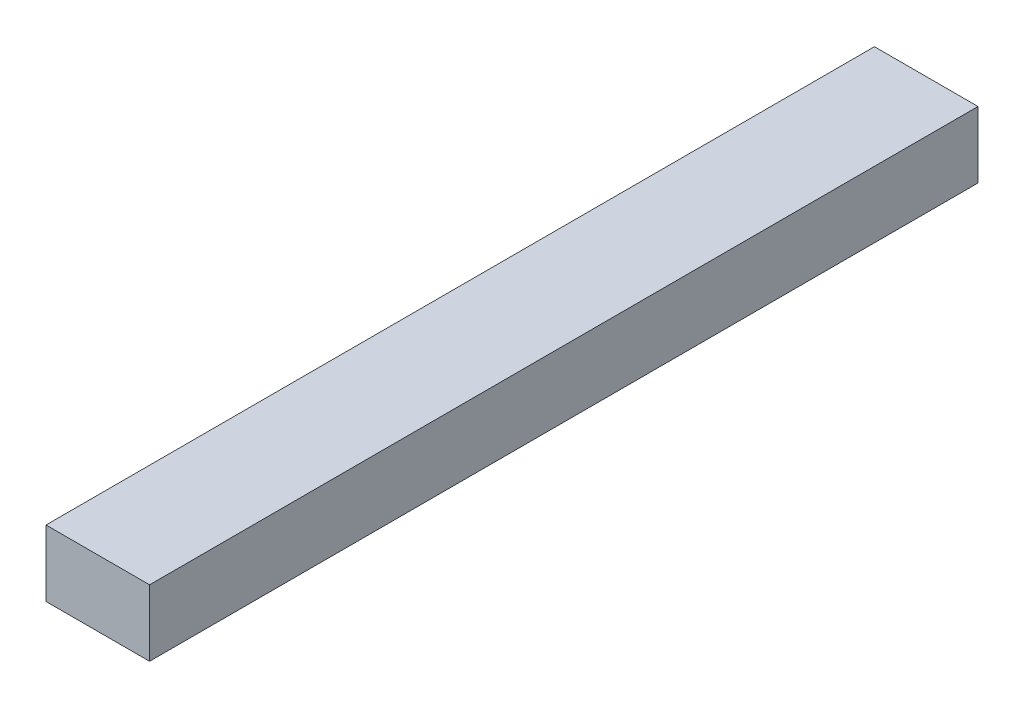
ISO-10303-21;
HEADER;
FILE_DESCRIPTION(('STEP AP214'),'2;1');
FILE_NAME('part.step','',(''),(''),'','','');
FILE_SCHEMA(('AUTOMOTIVE_DESIGN { 1 0 10303 214 1 1 1 1 }'));
ENDSEC;
DATA;
#1=APPLICATION_CONTEXT('core data for automotive mechanical design processes');
#2=APPLICATION_PROTOCOL_DEFINITION('international standard','automotive_design',2000,#1);
#3=PRODUCT_CONTEXT('',#1,'mechanical');
#4=PRODUCT('Part','Part','',(#3));
#5=PRODUCT_RELATED_PRODUCT_CATEGORY('part','',(#4));
#6=PRODUCT_DEFINITION_FORMATION('','',#4);
#7=PRODUCT_DEFINITION_CONTEXT('part definition',#1,'design');
#8=PRODUCT_DEFINITION('design','',#6,#7);
#9=PRODUCT_DEFINITION_SHAPE('','',#8);
#10=(LENGTH_UNIT() NAMED_UNIT(*) SI_UNIT(.MILLI.,.METRE.));
#11=(NAMED_UNIT(*) PLANE_ANGLE_UNIT() SI_UNIT($,.RADIAN.));
#12=(NAMED_UNIT(*) SI_UNIT($,.STERADIAN.) SOLID_ANGLE_UNIT());
#13=UNCERTAINTY_MEASURE_WITH_UNIT(LENGTH_MEASURE(1.E-05),#10,'distance_accuracy_value','');
#14=(GEOMETRIC_REPRESENTATION_CONTEXT(3) GLOBAL_UNCERTAINTY_ASSIGNED_CONTEXT((#13)) GLOBAL_UNIT_ASSIGNED_CONTEXT((#10,
#11,#12)) REPRESENTATION_CONTEXT('',''));
#15=CARTESIAN_POINT('',(0.,0.,0.));
#16=DIRECTION('',(0.,0.,1.));
#17=DIRECTION('',(1.,0.,0.));
#18=AXIS2_PLACEMENT_3D('',#15,#16,#17);
#19=CARTESIAN_POINT('',(-27.5,-17.5,-200.));
#20=DIRECTION('',(0.,0.,1.));
#21=DIRECTION('',(1.,0.,0.));
#22=AXIS2_PLACEMENT_3D('',#19,#20,#21);
#23=PLANE('',#22);
#24=DIRECTION('',(-1.,0.,0.));
#25=VECTOR('',#24,1.);
#26=CARTESIAN_POINT('',(25.,16.,-200.));
#27=LINE('',#26,#25);
#28=CARTESIAN_POINT('',(25.,16.,-200.));
#29=VERTEX_POINT('',#28);
#30=CARTESIAN_POINT('',(-25.,16.,-200.));
#31=VERTEX_POINT('',#30);
#32=EDGE_CURVE('E59',#29,#31,#27,.T.);
#33=ORIENTED_EDGE('',*,*,#32,.F.);
#34=DIRECTION('',(0.,1.,0.));
#35=VECTOR('',#34,1.);
#36=CARTESIAN_POINT('',(25.,-16.,-200.));
#37=LINE('',#36,#35);
#38=CARTESIAN_POINT('',(25.,-16.,-200.));
#39=VERTEX_POINT('',#38);
#40=EDGE_CURVE('E83',#39,#29,#37,.T.);
#41=ORIENTED_EDGE('',*,*,#40,.F.);
#42=DIRECTION('',(1.,0.,0.));
#43=VECTOR('',#42,1.);
#44=CARTESIAN_POINT('',(-25.,-16.,-200.));
#45=LINE('',#44,#43);
#46=CARTESIAN_POINT('',(-25.,-16.,-200.));
#47=VERTEX_POINT('',#46);
#48=EDGE_CURVE('E99',#47,#39,#45,.T.);
#49=ORIENTED_EDGE('',*,*,#48,.F.);
#50=DIRECTION('',(0.,-1.,0.));
#51=VECTOR('',#50,1.);
#52=CARTESIAN_POINT('',(-25.,16.,-200.));
#53=LINE('',#52,#51);
#54=EDGE_CURVE('E97',#31,#47,#53,.T.);
#55=ORIENTED_EDGE('',*,*,#54,.F.);
#56=EDGE_LOOP('',(#33,#41,#49,#55));
#57=FACE_BOUND('',#56,.T.);
#58=ADVANCED_FACE('F35',(#57),#23,.F.);
#59=CARTESIAN_POINT('',(25.,16.,-200.));
#60=DIRECTION('',(0.,1.,0.));
#61=DIRECTION('',(-1.,0.,0.));
#62=AXIS2_PLACEMENT_3D('',#59,#60,#61);
#63=PLANE('',#62);
#64=DIRECTION('',(0.,0.,1.));
#65=VECTOR('',#64,1.);
#66=CARTESIAN_POINT('',(25.,16.,-200.));
#67=LINE('',#66,#65);
#68=CARTESIAN_POINT('',(25.,16.,200.));
#69=VERTEX_POINT('',#68);
#70=EDGE_CURVE('E11',#29,#69,#67,.T.);
#71=ORIENTED_EDGE('',*,*,#70,.F.);
#72=ORIENTED_EDGE('',*,*,#32,.T.);
#73=DIRECTION('',(0.,0.,1.));
#74=VECTOR('',#73,1.);
#75=CARTESIAN_POINT('',(-25.,16.,-200.));
#76=LINE('',#75,#74);
#77=CARTESIAN_POINT('',(-25.,16.,200.));
#78=VERTEX_POINT('',#77);
#79=EDGE_CURVE('E38',#31,#78,#76,.T.);
#80=ORIENTED_EDGE('',*,*,#79,.T.);
#81=DIRECTION('',(-1.,0.,0.));
#82=VECTOR('',#81,1.);
#83=CARTESIAN_POINT('',(25.,16.,200.));
#84=LINE('',#83,#82);
#85=EDGE_CURVE('E77',#69,#78,#84,.T.);
#86=ORIENTED_EDGE('',*,*,#85,.F.);
#87=EDGE_LOOP('',(#71,#72,#80,#86));
#88=FACE_BOUND('',#87,.T.);
#89=ADVANCED_FACE('F75',(#88),#63,.T.);
#90=CARTESIAN_POINT('',(25.,-16.,-200.));
#91=DIRECTION('',(1.,0.,0.));
#92=DIRECTION('',(0.,1.,0.));
#93=AXIS2_PLACEMENT_3D('',#90,#91,#92);
#94=PLANE('',#93);
#95=DIRECTION('',(0.,0.,1.));
#96=VECTOR('',#95,1.);
#97=CARTESIAN_POINT('',(25.,-16.,-200.));
#98=LINE('',#97,#96);
#99=CARTESIAN_POINT('',(25.,-16.,200.));
#100=VERTEX_POINT('',#99);
#101=EDGE_CURVE('E43',#39,#100,#98,.T.);
#102=ORIENTED_EDGE('',*,*,#101,.F.);
#103=ORIENTED_EDGE('',*,*,#40,.T.);
#104=ORIENTED_EDGE('',*,*,#70,.T.);
#105=DIRECTION('',(0.,1.,0.));
#106=VECTOR('',#105,1.);
#107=CARTESIAN_POINT('',(25.,-16.,200.));
#108=LINE('',#107,#106);
#109=EDGE_CURVE('E91',#100,#69,#108,.T.);
#110=ORIENTED_EDGE('',*,*,#109,.F.);
#111=EDGE_LOOP('',(#102,#103,#104,#110));
#112=FACE_BOUND('',#111,.T.);
#113=ADVANCED_FACE('F108',(#112),#94,.T.);
#114=CARTESIAN_POINT('',(-25.,-16.,-200.));
#115=DIRECTION('',(0.,-1.,0.));
#116=DIRECTION('',(0.,0.,-1.));
#117=AXIS2_PLACEMENT_3D('',#114,#115,#116);
#118=PLANE('',#117);
#119=DIRECTION('',(0.,0.,1.));
#120=VECTOR('',#119,1.);
#121=CARTESIAN_POINT('',(-25.,-16.,-200.));
#122=LINE('',#121,#120);
#123=CARTESIAN_POINT('',(-25.,-16.,200.));
#124=VERTEX_POINT('',#123);
#125=EDGE_CURVE('E82',#47,#124,#122,.T.);
#126=ORIENTED_EDGE('',*,*,#125,.F.);
#127=ORIENTED_EDGE('',*,*,#48,.T.);
#128=ORIENTED_EDGE('',*,*,#101,.T.);
#129=DIRECTION('',(1.,0.,0.));
#130=VECTOR('',#129,1.);
#131=CARTESIAN_POINT('',(-25.,-16.,200.));
#132=LINE('',#131,#130);
#133=EDGE_CURVE('E51',#124,#100,#132,.T.);
#134=ORIENTED_EDGE('',*,*,#133,.F.);
#135=EDGE_LOOP('',(#126,#127,#128,#134));
#136=FACE_BOUND('',#135,.T.);
#137=ADVANCED_FACE('F104',(#136),#118,.T.);
#138=CARTESIAN_POINT('',(-25.,16.,-200.));
#139=DIRECTION('',(-1.,0.,0.));
#140=DIRECTION('',(0.,-1.,0.));
#141=AXIS2_PLACEMENT_3D('',#138,#139,#140);
#142=PLANE('',#141);
#143=ORIENTED_EDGE('',*,*,#79,.F.);
#144=ORIENTED_EDGE('',*,*,#54,.T.);
#145=ORIENTED_EDGE('',*,*,#125,.T.);
#146=DIRECTION('',(0.,-1.,0.));
#147=VECTOR('',#146,1.);
#148=CARTESIAN_POINT('',(-25.,16.,200.));
#149=LINE('',#148,#147);
#150=EDGE_CURVE('E85',#78,#124,#149,.T.);
#151=ORIENTED_EDGE('',*,*,#150,.F.);
#152=EDGE_LOOP('',(#143,#144,#145,#151));
#153=FACE_BOUND('',#152,.T.);
#154=ADVANCED_FACE('F86',(#153),#142,.T.);
#155=CARTESIAN_POINT('',(-27.5,-17.5,200.));
#156=DIRECTION('',(0.,0.,1.));
#157=DIRECTION('',(1.,0.,0.));
#158=AXIS2_PLACEMENT_3D('',#155,#156,#157);
#159=PLANE('',#158);
#160=ORIENTED_EDGE('',*,*,#109,.T.);
#161=ORIENTED_EDGE('',*,*,#85,.T.);
#162=ORIENTED_EDGE('',*,*,#150,.T.);
#163=ORIENTED_EDGE('',*,*,#133,.T.);
#164=EDGE_LOOP('',(#160,#161,#162,#163));
#165=FACE_BOUND('',#164,.T.);
#166=ADVANCED_FACE('F89',(#165),#159,.T.);
#167=CLOSED_SHELL('',(#58,#89,#113,#137,#154,#166));
#168=MANIFOLD_SOLID_BREP('B2',#167);
#169=ADVANCED_BREP_SHAPE_REPRESENTATION('',(#18,#168),#14);
#170=SHAPE_DEFINITION_REPRESENTATION(#9,#169);
ENDSEC;
END-ISO-10303-21;
